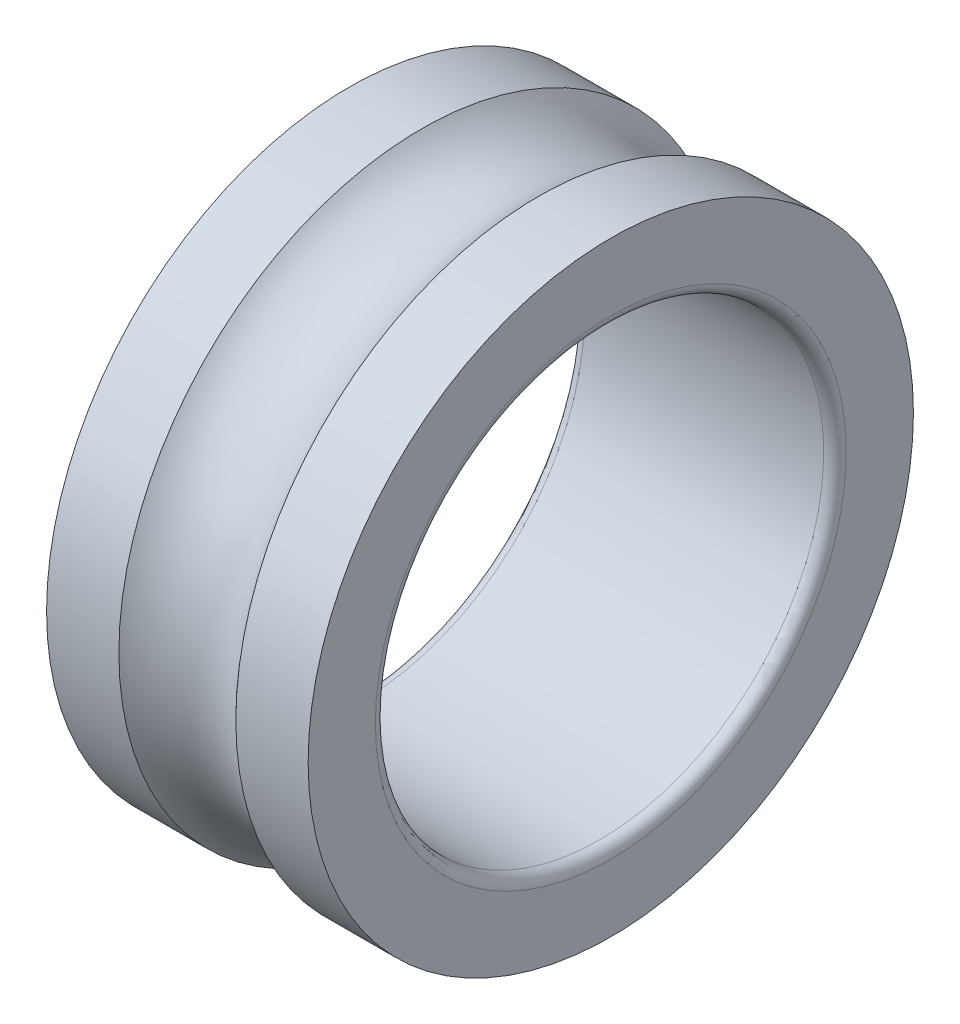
ISO-10303-21;
HEADER;
FILE_DESCRIPTION(('STEP AP214'),'2;1');
FILE_NAME('part.step','',(''),(''),'','','');
FILE_SCHEMA(('AUTOMOTIVE_DESIGN { 1 0 10303 214 1 1 1 1 }'));
ENDSEC;
DATA;
#1=APPLICATION_CONTEXT('core data for automotive mechanical design processes');
#2=APPLICATION_PROTOCOL_DEFINITION('international standard','automotive_design',2000,#1);
#3=PRODUCT_CONTEXT('',#1,'mechanical');
#4=PRODUCT('Part','Part','',(#3));
#5=PRODUCT_RELATED_PRODUCT_CATEGORY('part','',(#4));
#6=PRODUCT_DEFINITION_FORMATION('','',#4);
#7=PRODUCT_DEFINITION_CONTEXT('part definition',#1,'design');
#8=PRODUCT_DEFINITION('design','',#6,#7);
#9=PRODUCT_DEFINITION_SHAPE('','',#8);
#10=(LENGTH_UNIT() NAMED_UNIT(*) SI_UNIT(.MILLI.,.METRE.));
#11=(NAMED_UNIT(*) PLANE_ANGLE_UNIT() SI_UNIT($,.RADIAN.));
#12=(NAMED_UNIT(*) SI_UNIT($,.STERADIAN.) SOLID_ANGLE_UNIT());
#13=UNCERTAINTY_MEASURE_WITH_UNIT(LENGTH_MEASURE(1.E-05),#10,'distance_accuracy_value','');
#14=(GEOMETRIC_REPRESENTATION_CONTEXT(3) GLOBAL_UNCERTAINTY_ASSIGNED_CONTEXT((#13)) GLOBAL_UNIT_ASSIGNED_CONTEXT((#10,
#11,#12)) REPRESENTATION_CONTEXT('',''));
#15=CARTESIAN_POINT('',(0.,0.,0.));
#16=DIRECTION('',(0.,0.,1.));
#17=DIRECTION('',(1.,0.,0.));
#18=AXIS2_PLACEMENT_3D('',#15,#16,#17);
#19=CARTESIAN_POINT('',(0.150000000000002,0.,0.));
#20=DIRECTION('',(-1.,0.,0.));
#21=DIRECTION('',(0.,0.,1.));
#22=AXIS2_PLACEMENT_3D('',#19,#20,#21);
#23=TOROIDAL_SURFACE('',#22,3.15,0.150000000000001);
#24=CARTESIAN_POINT('',(0.150000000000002,0.,0.));
#25=DIRECTION('',(-1.,0.,0.));
#26=DIRECTION('',(0.,0.,1.));
#27=AXIS2_PLACEMENT_3D('',#24,#25,#26);
#28=CIRCLE('',#27,3.);
#29=CARTESIAN_POINT('',(0.150000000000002,0.,3.));
#30=VERTEX_POINT('',#29);
#31=EDGE_CURVE('E10',#30,#30,#28,.T.);
#32=ORIENTED_EDGE('',*,*,#31,.F.);
#33=EDGE_LOOP('',(#32));
#34=FACE_BOUND('',#33,.T.);
#35=CARTESIAN_POINT('',(0.,0.,0.));
#36=DIRECTION('',(-1.,0.,0.));
#37=DIRECTION('',(0.,0.,1.));
#38=AXIS2_PLACEMENT_3D('',#35,#36,#37);
#39=CIRCLE('',#38,3.15);
#40=CARTESIAN_POINT('',(0.,0.,3.15));
#41=VERTEX_POINT('',#40);
#42=EDGE_CURVE('E388',#41,#41,#39,.T.);
#43=ORIENTED_EDGE('',*,*,#42,.T.);
#44=EDGE_LOOP('',(#43));
#45=FACE_BOUND('',#44,.T.);
#46=ADVANCED_FACE('F360',(#34,#45),#23,.T.);
#47=CARTESIAN_POINT('',(0.,0.,0.));
#48=DIRECTION('',(-1.,0.,0.));
#49=DIRECTION('',(0.,0.,1.));
#50=AXIS2_PLACEMENT_3D('',#47,#48,#49);
#51=CYLINDRICAL_SURFACE('',#50,3.);
#52=CARTESIAN_POINT('',(3.35,0.,0.));
#53=DIRECTION('',(-1.,0.,0.));
#54=DIRECTION('',(0.,0.,1.));
#55=AXIS2_PLACEMENT_3D('',#52,#53,#54);
#56=CIRCLE('',#55,3.);
#57=CARTESIAN_POINT('',(3.35,0.,3.));
#58=VERTEX_POINT('',#57);
#59=EDGE_CURVE('E366',#58,#58,#56,.T.);
#60=ORIENTED_EDGE('',*,*,#59,.F.);
#61=EDGE_LOOP('',(#60));
#62=FACE_BOUND('',#61,.T.);
#63=ORIENTED_EDGE('',*,*,#31,.T.);
#64=EDGE_LOOP('',(#63));
#65=FACE_BOUND('',#64,.T.);
#66=ADVANCED_FACE('F425',(#62,#65),#51,.F.);
#67=CARTESIAN_POINT('',(3.35,0.,0.));
#68=DIRECTION('',(-1.,0.,0.));
#69=DIRECTION('',(0.,0.,1.));
#70=AXIS2_PLACEMENT_3D('',#67,#68,#69);
#71=TOROIDAL_SURFACE('',#70,3.15,0.15);
#72=CARTESIAN_POINT('',(3.5,0.,0.));
#73=DIRECTION('',(-1.,0.,0.));
#74=DIRECTION('',(0.,0.,1.));
#75=AXIS2_PLACEMENT_3D('',#72,#73,#74);
#76=CIRCLE('',#75,3.15);
#77=CARTESIAN_POINT('',(3.5,0.,3.15));
#78=VERTEX_POINT('',#77);
#79=EDGE_CURVE('E370',#78,#78,#76,.T.);
#80=ORIENTED_EDGE('',*,*,#79,.F.);
#81=EDGE_LOOP('',(#80));
#82=FACE_BOUND('',#81,.T.);
#83=ORIENTED_EDGE('',*,*,#59,.T.);
#84=EDGE_LOOP('',(#83));
#85=FACE_BOUND('',#84,.T.);
#86=ADVANCED_FACE('F420',(#82,#85),#71,.T.);
#87=CARTESIAN_POINT('',(3.5,0.,-4.05));
#88=DIRECTION('',(-1.,0.,0.));
#89=DIRECTION('',(0.,0.,1.));
#90=AXIS2_PLACEMENT_3D('',#87,#88,#89);
#91=PLANE('',#90);
#92=CARTESIAN_POINT('',(3.5,0.,0.));
#93=DIRECTION('',(-1.,0.,0.));
#94=DIRECTION('',(0.,0.,1.));
#95=AXIS2_PLACEMENT_3D('',#92,#93,#94);
#96=CIRCLE('',#95,4.05);
#97=CARTESIAN_POINT('',(3.5,0.,4.05));
#98=VERTEX_POINT('',#97);
#99=EDGE_CURVE('E374',#98,#98,#96,.T.);
#100=ORIENTED_EDGE('',*,*,#99,.F.);
#101=EDGE_LOOP('',(#100));
#102=FACE_BOUND('',#101,.T.);
#103=ORIENTED_EDGE('',*,*,#79,.T.);
#104=EDGE_LOOP('',(#103));
#105=FACE_BOUND('',#104,.T.);
#106=ADVANCED_FACE('F414',(#102,#105),#91,.F.);
#107=CARTESIAN_POINT('',(0.,0.,0.));
#108=DIRECTION('',(-1.,0.,0.));
#109=DIRECTION('',(0.,0.,1.));
#110=AXIS2_PLACEMENT_3D('',#107,#108,#109);
#111=CYLINDRICAL_SURFACE('',#110,4.05);
#112=CARTESIAN_POINT('',(2.53262379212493,0.,0.));
#113=DIRECTION('',(-1.,0.,0.));
#114=DIRECTION('',(0.,0.,1.));
#115=AXIS2_PLACEMENT_3D('',#112,#113,#114);
#116=CIRCLE('',#115,4.05);
#117=CARTESIAN_POINT('',(2.53262379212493,0.,4.05));
#118=VERTEX_POINT('',#117);
#119=EDGE_CURVE('E379',#118,#118,#116,.T.);
#120=ORIENTED_EDGE('',*,*,#119,.F.);
#121=EDGE_LOOP('',(#120));
#122=FACE_BOUND('',#121,.T.);
#123=ORIENTED_EDGE('',*,*,#99,.T.);
#124=EDGE_LOOP('',(#123));
#125=FACE_BOUND('',#124,.T.);
#126=ADVANCED_FACE('F408',(#122,#125),#111,.T.);
#127=CARTESIAN_POINT('',(1.75,0.,0.));
#128=DIRECTION('',(-1.,0.,0.));
#129=DIRECTION('',(0.,0.,1.));
#130=AXIS2_PLACEMENT_3D('',#127,#128,#129);
#131=TOROIDAL_SURFACE('',#130,4.75,1.05);
#132=CARTESIAN_POINT('',(0.967376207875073,0.,0.));
#133=DIRECTION('',(-1.,0.,0.));
#134=DIRECTION('',(0.,0.,1.));
#135=AXIS2_PLACEMENT_3D('',#132,#133,#134);
#136=CIRCLE('',#135,4.05);
#137=CARTESIAN_POINT('',(0.967376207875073,0.,4.05));
#138=VERTEX_POINT('',#137);
#139=EDGE_CURVE('E382',#138,#138,#136,.T.);
#140=ORIENTED_EDGE('',*,*,#139,.F.);
#141=EDGE_LOOP('',(#140));
#142=FACE_BOUND('',#141,.T.);
#143=ORIENTED_EDGE('',*,*,#119,.T.);
#144=EDGE_LOOP('',(#143));
#145=FACE_BOUND('',#144,.T.);
#146=ADVANCED_FACE('F402',(#142,#145),#131,.F.);
#147=CARTESIAN_POINT('',(0.,0.,0.));
#148=DIRECTION('',(-1.,0.,0.));
#149=DIRECTION('',(0.,0.,1.));
#150=AXIS2_PLACEMENT_3D('',#147,#148,#149);
#151=CYLINDRICAL_SURFACE('',#150,4.05);
#152=CARTESIAN_POINT('',(0.,0.,0.));
#153=DIRECTION('',(-1.,0.,0.));
#154=DIRECTION('',(0.,0.,1.));
#155=AXIS2_PLACEMENT_3D('',#152,#153,#154);
#156=CIRCLE('',#155,4.05);
#157=CARTESIAN_POINT('',(0.,0.,4.05));
#158=VERTEX_POINT('',#157);
#159=EDGE_CURVE('E385',#158,#158,#156,.T.);
#160=ORIENTED_EDGE('',*,*,#159,.F.);
#161=EDGE_LOOP('',(#160));
#162=FACE_BOUND('',#161,.T.);
#163=ORIENTED_EDGE('',*,*,#139,.T.);
#164=EDGE_LOOP('',(#163));
#165=FACE_BOUND('',#164,.T.);
#166=ADVANCED_FACE('F396',(#162,#165),#151,.T.);
#167=CARTESIAN_POINT('',(0.,0.,-4.05));
#168=DIRECTION('',(1.,0.,0.));
#169=DIRECTION('',(0.,0.,-1.));
#170=AXIS2_PLACEMENT_3D('',#167,#168,#169);
#171=PLANE('',#170);
#172=ORIENTED_EDGE('',*,*,#42,.F.);
#173=EDGE_LOOP('',(#172));
#174=FACE_BOUND('',#173,.T.);
#175=ORIENTED_EDGE('',*,*,#159,.T.);
#176=EDGE_LOOP('',(#175));
#177=FACE_BOUND('',#176,.T.);
#178=ADVANCED_FACE('F393',(#174,#177),#171,.F.);
#179=CLOSED_SHELL('',(#46,#66,#86,#106,#126,#146,#166,#178));
#180=MANIFOLD_SOLID_BREP('B2',#179);
#181=ADVANCED_BREP_SHAPE_REPRESENTATION('',(#18,#180),#14);
#182=SHAPE_DEFINITION_REPRESENTATION(#9,#181);
ENDSEC;
END-ISO-10303-21;
